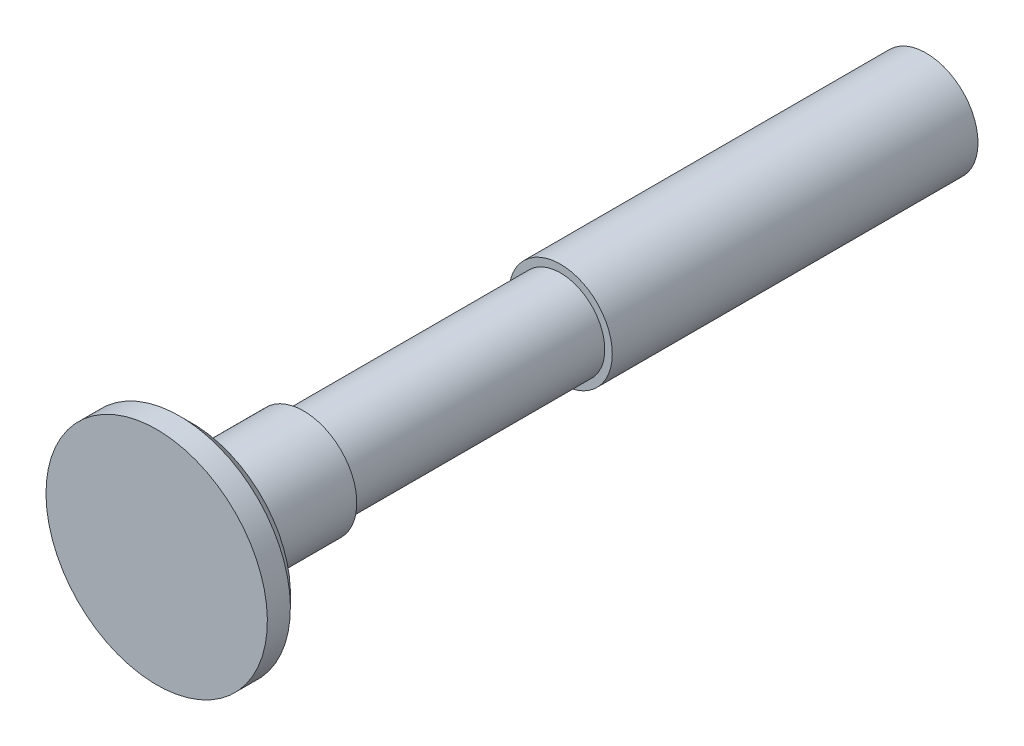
ISO-10303-21;
HEADER;
FILE_DESCRIPTION(('STEP AP214'),'2;1');
FILE_NAME('part.step','',(''),(''),'','','');
FILE_SCHEMA(('AUTOMOTIVE_DESIGN { 1 0 10303 214 1 1 1 1 }'));
ENDSEC;
DATA;
#1=APPLICATION_CONTEXT('core data for automotive mechanical design processes');
#2=APPLICATION_PROTOCOL_DEFINITION('international standard','automotive_design',2000,#1);
#3=PRODUCT_CONTEXT('',#1,'mechanical');
#4=PRODUCT('Part','Part','',(#3));
#5=PRODUCT_RELATED_PRODUCT_CATEGORY('part','',(#4));
#6=PRODUCT_DEFINITION_FORMATION('','',#4);
#7=PRODUCT_DEFINITION_CONTEXT('part definition',#1,'design');
#8=PRODUCT_DEFINITION('design','',#6,#7);
#9=PRODUCT_DEFINITION_SHAPE('','',#8);
#10=(LENGTH_UNIT() NAMED_UNIT(*) SI_UNIT(.MILLI.,.METRE.));
#11=(NAMED_UNIT(*) PLANE_ANGLE_UNIT() SI_UNIT($,.RADIAN.));
#12=(NAMED_UNIT(*) SI_UNIT($,.STERADIAN.) SOLID_ANGLE_UNIT());
#13=UNCERTAINTY_MEASURE_WITH_UNIT(LENGTH_MEASURE(1.E-05),#10,'distance_accuracy_value','');
#14=(GEOMETRIC_REPRESENTATION_CONTEXT(3) GLOBAL_UNCERTAINTY_ASSIGNED_CONTEXT((#13)) GLOBAL_UNIT_ASSIGNED_CONTEXT((#10,
#11,#12)) REPRESENTATION_CONTEXT('',''));
#15=CARTESIAN_POINT('',(0.,0.,0.));
#16=DIRECTION('',(0.,0.,1.));
#17=DIRECTION('',(1.,0.,0.));
#18=AXIS2_PLACEMENT_3D('',#15,#16,#17);
#19=CARTESIAN_POINT('',(0.,0.,38.));
#20=DIRECTION('',(0.,0.,-1.));
#21=DIRECTION('',(-1.,0.,0.));
#22=AXIS2_PLACEMENT_3D('',#19,#20,#21);
#23=CYLINDRICAL_SURFACE('',#22,5.);
#24=CARTESIAN_POINT('',(0.,0.,0.));
#25=DIRECTION('',(0.,0.,1.));
#26=DIRECTION('',(1.,0.,0.));
#27=AXIS2_PLACEMENT_3D('',#24,#25,#26);
#28=CIRCLE('',#27,5.);
#29=CARTESIAN_POINT('',(5.,0.,0.));
#30=VERTEX_POINT('',#29);
#31=EDGE_CURVE('E31',#30,#30,#28,.T.);
#32=ORIENTED_EDGE('',*,*,#31,.T.);
#33=EDGE_LOOP('',(#32));
#34=FACE_BOUND('',#33,.T.);
#35=CARTESIAN_POINT('',(0.,0.,29.));
#36=DIRECTION('',(0.,0.,1.));
#37=DIRECTION('',(1.,0.,0.));
#38=AXIS2_PLACEMENT_3D('',#35,#36,#37);
#39=CIRCLE('',#38,5.);
#40=CARTESIAN_POINT('',(5.,0.,29.));
#41=VERTEX_POINT('',#40);
#42=EDGE_CURVE('E9',#41,#41,#39,.T.);
#43=ORIENTED_EDGE('',*,*,#42,.F.);
#44=EDGE_LOOP('',(#43));
#45=FACE_BOUND('',#44,.T.);
#46=ADVANCED_FACE('F14',(#34,#45),#23,.T.);
#47=CARTESIAN_POINT('',(0.,0.,0.));
#48=DIRECTION('',(0.,0.,1.));
#49=DIRECTION('',(1.,0.,0.));
#50=AXIS2_PLACEMENT_3D('',#47,#48,#49);
#51=PLANE('',#50);
#52=CARTESIAN_POINT('',(0.,0.,0.));
#53=DIRECTION('',(0.,0.,1.));
#54=DIRECTION('',(1.,0.,0.));
#55=AXIS2_PLACEMENT_3D('',#52,#53,#54);
#56=CIRCLE('',#55,5.85);
#57=CARTESIAN_POINT('',(5.85,0.,0.));
#58=VERTEX_POINT('',#57);
#59=EDGE_CURVE('E26',#58,#58,#56,.T.);
#60=ORIENTED_EDGE('',*,*,#59,.T.);
#61=EDGE_LOOP('',(#60));
#62=FACE_BOUND('',#61,.T.);
#63=ORIENTED_EDGE('',*,*,#31,.F.);
#64=EDGE_LOOP('',(#63));
#65=FACE_BOUND('',#64,.T.);
#66=ADVANCED_FACE('F92',(#62,#65),#51,.T.);
#67=CARTESIAN_POINT('',(0.,0.,-41.3));
#68=DIRECTION('',(0.,0.,1.));
#69=DIRECTION('',(1.,0.,0.));
#70=AXIS2_PLACEMENT_3D('',#67,#68,#69);
#71=CYLINDRICAL_SURFACE('',#70,5.85);
#72=CARTESIAN_POINT('',(0.,0.,-41.3));
#73=DIRECTION('',(0.,0.,1.));
#74=DIRECTION('',(1.,0.,0.));
#75=AXIS2_PLACEMENT_3D('',#72,#73,#74);
#76=CIRCLE('',#75,5.85);
#77=CARTESIAN_POINT('',(5.85,0.,-41.3));
#78=VERTEX_POINT('',#77);
#79=EDGE_CURVE('E22',#78,#78,#76,.T.);
#80=CARTESIAN_POINT('',(5.85,0.,-41.3));
#81=CARTESIAN_POINT('',(5.85,0.,-40.8697916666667));
#82=CARTESIAN_POINT('',(5.85,0.,-40.4395833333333));
#83=CARTESIAN_POINT('',(5.85,0.,-39.5791666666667));
#84=CARTESIAN_POINT('',(5.85,0.,-39.1489583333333));
#85=CARTESIAN_POINT('',(5.85,0.,-38.2885416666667));
#86=CARTESIAN_POINT('',(5.85,0.,-37.8583333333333));
#87=CARTESIAN_POINT('',(5.85,0.,-36.9979166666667));
#88=CARTESIAN_POINT('',(5.85,0.,-36.5677083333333));
#89=CARTESIAN_POINT('',(5.85,0.,-35.7072916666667));
#90=CARTESIAN_POINT('',(5.85,0.,-35.2770833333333));
#91=CARTESIAN_POINT('',(5.85,0.,-34.4166666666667));
#92=CARTESIAN_POINT('',(5.85,0.,-33.9864583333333));
#93=CARTESIAN_POINT('',(5.85,0.,-33.1260416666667));
#94=CARTESIAN_POINT('',(5.85,0.,-32.6958333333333));
#95=CARTESIAN_POINT('',(5.85,0.,-31.8354166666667));
#96=CARTESIAN_POINT('',(5.85,0.,-31.4052083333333));
#97=CARTESIAN_POINT('',(5.85,0.,-30.5447916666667));
#98=CARTESIAN_POINT('',(5.85,0.,-30.1145833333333));
#99=CARTESIAN_POINT('',(5.85,0.,-29.2541666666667));
#100=CARTESIAN_POINT('',(5.85,0.,-28.8239583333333));
#101=CARTESIAN_POINT('',(5.85,0.,-27.9635416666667));
#102=CARTESIAN_POINT('',(5.85,0.,-27.5333333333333));
#103=CARTESIAN_POINT('',(5.85,0.,-26.6729166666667));
#104=CARTESIAN_POINT('',(5.85,0.,-26.2427083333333));
#105=CARTESIAN_POINT('',(5.85,0.,-25.3822916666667));
#106=CARTESIAN_POINT('',(5.85,0.,-24.9520833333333));
#107=CARTESIAN_POINT('',(5.85,0.,-24.0916666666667));
#108=CARTESIAN_POINT('',(5.85,0.,-23.6614583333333));
#109=CARTESIAN_POINT('',(5.85,0.,-22.8010416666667));
#110=CARTESIAN_POINT('',(5.85,0.,-22.3708333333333));
#111=CARTESIAN_POINT('',(5.85,0.,-21.5104166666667));
#112=CARTESIAN_POINT('',(5.85,0.,-21.0802083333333));
#113=CARTESIAN_POINT('',(5.85,0.,-20.2197916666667));
#114=CARTESIAN_POINT('',(5.85,0.,-19.7895833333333));
#115=CARTESIAN_POINT('',(5.85,0.,-18.9291666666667));
#116=CARTESIAN_POINT('',(5.85,0.,-18.4989583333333));
#117=CARTESIAN_POINT('',(5.85,0.,-17.6385416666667));
#118=CARTESIAN_POINT('',(5.85,0.,-17.2083333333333));
#119=CARTESIAN_POINT('',(5.85,0.,-16.3479166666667));
#120=CARTESIAN_POINT('',(5.85,0.,-15.9177083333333));
#121=CARTESIAN_POINT('',(5.85,0.,-15.0572916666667));
#122=CARTESIAN_POINT('',(5.85,0.,-14.6270833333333));
#123=CARTESIAN_POINT('',(5.85,0.,-13.7666666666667));
#124=CARTESIAN_POINT('',(5.85,0.,-13.3364583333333));
#125=CARTESIAN_POINT('',(5.85,0.,-12.4760416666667));
#126=CARTESIAN_POINT('',(5.85,0.,-12.0458333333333));
#127=CARTESIAN_POINT('',(5.85,0.,-11.1854166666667));
#128=CARTESIAN_POINT('',(5.85,0.,-10.7552083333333));
#129=CARTESIAN_POINT('',(5.85,0.,-9.89479166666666));
#130=CARTESIAN_POINT('',(5.85,0.,-9.46458333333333));
#131=CARTESIAN_POINT('',(5.85,0.,-8.60416666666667));
#132=CARTESIAN_POINT('',(5.85,0.,-8.17395833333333));
#133=CARTESIAN_POINT('',(5.85,0.,-7.31354166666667));
#134=CARTESIAN_POINT('',(5.85,0.,-6.88333333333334));
#135=CARTESIAN_POINT('',(5.85,0.,-6.02291666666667));
#136=CARTESIAN_POINT('',(5.85,0.,-5.59270833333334));
#137=CARTESIAN_POINT('',(5.85,0.,-4.73229166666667));
#138=CARTESIAN_POINT('',(5.85,0.,-4.30208333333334));
#139=CARTESIAN_POINT('',(5.85,0.,-3.44166666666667));
#140=CARTESIAN_POINT('',(5.85,0.,-3.01145833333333));
#141=CARTESIAN_POINT('',(5.85,0.,-2.15104166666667));
#142=CARTESIAN_POINT('',(5.85,0.,-1.72083333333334));
#143=CARTESIAN_POINT('',(5.85,0.,-0.860416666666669));
#144=CARTESIAN_POINT('',(5.85,0.,-0.430208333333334));
#145=CARTESIAN_POINT('',(5.85,0.,0.));
#146=B_SPLINE_CURVE_WITH_KNOTS('',3,(#80,#81,#82,#83,#84,#85,#86,#87,#88,#89,#90,#91,#92,#93,
#94,#95,#96,#97,#98,#99,#100,#101,#102,#103,#104,#105,#106,#107,#108,#109,#110,#111,#112,#113,
#114,#115,#116,#117,#118,#119,#120,#121,#122,#123,#124,#125,#126,#127,#128,#129,#130,#131,#132,
#133,#134,#135,#136,#137,#138,#139,#140,#141,#142,#143,#144,#145),.UNSPECIFIED.,.F.,.F.,(4,2,2,
2,2,2,2,2,2,2,2,2,2,2,2,2,2,2,2,2,2,2,2,2,2,2,2,2,2,2,2,2,4),(0.,1.290625,2.58125000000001,
3.871875,5.1625,6.453125,7.74375000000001,9.034375,10.325,11.615625,12.90625,14.196875,15.4875,
16.778125,18.06875,19.359375,20.65,21.940625,23.23125,24.521875,25.8125,27.103125,28.39375,
29.684375,30.975,32.265625,33.55625,34.846875,36.1375,37.428125,38.71875,40.009375,41.3),.UNSPECIFIED.);
#147=EDGE_CURVE('BSEAM16',#78,#58,#146,.T.);
#148=ORIENTED_EDGE('',*,*,#79,.T.);
#149=ORIENTED_EDGE('',*,*,#59,.F.);
#150=ORIENTED_EDGE('',*,*,#147,.T.);
#151=ORIENTED_EDGE('',*,*,#147,.F.);
#152=EDGE_LOOP('',(#148,#150,#149,#151));
#153=FACE_BOUND('',#152,.T.);
#154=ADVANCED_FACE('F16',(#153),#71,.T.);
#155=CARTESIAN_POINT('',(0.,0.,-41.3));
#156=DIRECTION('',(0.,0.,1.));
#157=DIRECTION('',(1.,0.,0.));
#158=AXIS2_PLACEMENT_3D('',#155,#156,#157);
#159=PLANE('',#158);
#160=ORIENTED_EDGE('',*,*,#79,.F.);
#161=EDGE_LOOP('',(#160));
#162=FACE_BOUND('',#161,.T.);
#163=ADVANCED_FACE('F105',(#162),#159,.F.);
#164=CARTESIAN_POINT('',(-4.28155412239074,-13.4735128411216,29.));
#165=DIRECTION('',(0.,0.,1.));
#166=DIRECTION('',(0.953037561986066,-0.302852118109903,0.));
#167=AXIS2_PLACEMENT_3D('',#164,#165,#166);
#168=PLANE('',#167);
#169=CARTESIAN_POINT('',(0.,0.,29.));
#170=DIRECTION('',(0.,0.,1.));
#171=DIRECTION('',(0.953037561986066,-0.302852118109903,0.));
#172=AXIS2_PLACEMENT_3D('',#169,#170,#171);
#173=CIRCLE('',#172,6.);
#174=CARTESIAN_POINT('',(5.71822537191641,-1.81711270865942,29.));
#175=VERTEX_POINT('',#174);
#176=EDGE_CURVE('E41',#175,#175,#173,.T.);
#177=ORIENTED_EDGE('',*,*,#176,.F.);
#178=EDGE_LOOP('',(#177));
#179=FACE_BOUND('',#178,.T.);
#180=ORIENTED_EDGE('',*,*,#42,.T.);
#181=EDGE_LOOP('',(#180));
#182=FACE_BOUND('',#181,.T.);
#183=ADVANCED_FACE('F107',(#179,#182),#168,.F.);
#184=CARTESIAN_POINT('',(-4.28155412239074,-13.4735128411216,45.6));
#185=DIRECTION('',(0.,0.,-1.));
#186=DIRECTION('',(-0.953037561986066,0.302852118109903,0.));
#187=AXIS2_PLACEMENT_3D('',#184,#185,#186);
#188=PLANE('',#187);
#189=CARTESIAN_POINT('',(0.,0.,45.6));
#190=DIRECTION('',(0.,0.,1.));
#191=DIRECTION('',(0.953037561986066,-0.302852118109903,0.));
#192=AXIS2_PLACEMENT_3D('',#189,#190,#191);
#193=CIRCLE('',#192,12.5);
#194=CARTESIAN_POINT('',(11.9129695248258,-3.78565147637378,45.6));
#195=VERTEX_POINT('',#194);
#196=EDGE_CURVE('E60',#195,#195,#193,.T.);
#197=ORIENTED_EDGE('',*,*,#196,.T.);
#198=EDGE_LOOP('',(#197));
#199=FACE_BOUND('',#198,.T.);
#200=ADVANCED_FACE('F64',(#199),#188,.F.);
#201=CARTESIAN_POINT('',(0.,0.,46.1));
#202=DIRECTION('',(0.,0.,1.));
#203=DIRECTION('',(0.953037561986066,-0.302852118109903,0.));
#204=AXIS2_PLACEMENT_3D('',#201,#202,#203);
#205=CYLINDRICAL_SURFACE('',#204,6.00000000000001);
#206=ORIENTED_EDGE('',*,*,#176,.T.);
#207=EDGE_LOOP('',(#206));
#208=FACE_BOUND('',#207,.T.);
#209=CARTESIAN_POINT('',(0.,0.,38.1));
#210=DIRECTION('',(0.,0.,1.));
#211=DIRECTION('',(0.953037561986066,-0.302852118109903,0.));
#212=AXIS2_PLACEMENT_3D('',#209,#210,#211);
#213=CIRCLE('',#212,6.00000000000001);
#214=CARTESIAN_POINT('',(5.71822537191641,-1.81711270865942,38.1));
#215=VERTEX_POINT('',#214);
#216=EDGE_CURVE('E46',#215,#215,#213,.T.);
#217=ORIENTED_EDGE('',*,*,#216,.F.);
#218=EDGE_LOOP('',(#217));
#219=FACE_BOUND('',#218,.T.);
#220=ADVANCED_FACE('F88',(#208,#219),#205,.T.);
#221=CARTESIAN_POINT('',(0.,0.,38.1));
#222=DIRECTION('',(0.,0.,1.));
#223=DIRECTION('',(0.953037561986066,-0.302852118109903,0.));
#224=AXIS2_PLACEMENT_3D('',#221,#222,#223);
#225=CONICAL_SURFACE('',#224,6.00000000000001,0.785398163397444);
#226=CARTESIAN_POINT('',(0.,0.,41.6));
#227=DIRECTION('',(0.,0.,1.));
#228=DIRECTION('',(0.953037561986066,-0.302852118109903,0.));
#229=AXIS2_PLACEMENT_3D('',#226,#227,#228);
#230=CIRCLE('',#229,9.50000000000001);
#231=CARTESIAN_POINT('',(9.05385683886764,-2.87709512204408,41.6));
#232=VERTEX_POINT('',#231);
#233=EDGE_CURVE('E51',#232,#232,#230,.T.);
#234=ORIENTED_EDGE('',*,*,#233,.F.);
#235=EDGE_LOOP('',(#234));
#236=FACE_BOUND('',#235,.T.);
#237=ORIENTED_EDGE('',*,*,#216,.T.);
#238=EDGE_LOOP('',(#237));
#239=FACE_BOUND('',#238,.T.);
#240=ADVANCED_FACE('F80',(#236,#239),#225,.T.);
#241=CARTESIAN_POINT('',(-4.28155412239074,-13.4735128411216,41.6));
#242=DIRECTION('',(0.,0.,-1.));
#243=DIRECTION('',(-0.953037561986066,0.302852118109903,0.));
#244=AXIS2_PLACEMENT_3D('',#241,#242,#243);
#245=PLANE('',#244);
#246=ORIENTED_EDGE('',*,*,#233,.T.);
#247=EDGE_LOOP('',(#246));
#248=FACE_BOUND('',#247,.T.);
#249=CARTESIAN_POINT('',(0.,0.,41.6));
#250=DIRECTION('',(0.,0.,1.));
#251=DIRECTION('',(0.953037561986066,-0.302852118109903,0.));
#252=AXIS2_PLACEMENT_3D('',#249,#250,#251);
#253=CIRCLE('',#252,11.1);
#254=CARTESIAN_POINT('',(10.5787169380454,-3.36165851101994,41.6));
#255=VERTEX_POINT('',#254);
#256=EDGE_CURVE('E54',#255,#255,#253,.T.);
#257=ORIENTED_EDGE('',*,*,#256,.F.);
#258=EDGE_LOOP('',(#257));
#259=FACE_BOUND('',#258,.T.);
#260=ADVANCED_FACE('F75',(#248,#259),#245,.T.);
#261=CARTESIAN_POINT('',(0.,0.,41.6));
#262=DIRECTION('',(0.,0.,1.));
#263=DIRECTION('',(0.953037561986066,-0.302852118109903,0.));
#264=AXIS2_PLACEMENT_3D('',#261,#262,#263);
#265=CONICAL_SURFACE('',#264,11.1,0.785398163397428);
#266=CARTESIAN_POINT('',(0.,0.,43.));
#267=DIRECTION('',(0.,0.,1.));
#268=DIRECTION('',(0.953037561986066,-0.302852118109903,0.));
#269=AXIS2_PLACEMENT_3D('',#266,#267,#268);
#270=CIRCLE('',#269,12.5);
#271=CARTESIAN_POINT('',(11.9129695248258,-3.78565147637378,43.));
#272=VERTEX_POINT('',#271);
#273=EDGE_CURVE('E57',#272,#272,#270,.T.);
#274=ORIENTED_EDGE('',*,*,#273,.F.);
#275=EDGE_LOOP('',(#274));
#276=FACE_BOUND('',#275,.T.);
#277=ORIENTED_EDGE('',*,*,#256,.T.);
#278=EDGE_LOOP('',(#277));
#279=FACE_BOUND('',#278,.T.);
#280=ADVANCED_FACE('F69',(#276,#279),#265,.T.);
#281=CARTESIAN_POINT('',(0.,0.,46.1));
#282=DIRECTION('',(0.,0.,1.));
#283=DIRECTION('',(0.953037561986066,-0.302852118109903,0.));
#284=AXIS2_PLACEMENT_3D('',#281,#282,#283);
#285=CYLINDRICAL_SURFACE('',#284,12.5);
#286=ORIENTED_EDGE('',*,*,#196,.F.);
#287=EDGE_LOOP('',(#286));
#288=FACE_BOUND('',#287,.T.);
#289=ORIENTED_EDGE('',*,*,#273,.T.);
#290=EDGE_LOOP('',(#289));
#291=FACE_BOUND('',#290,.T.);
#292=ADVANCED_FACE('F66',(#288,#291),#285,.T.);
#293=CLOSED_SHELL('',(#46,#66,#154,#163,#183,#200,#220,#240,#260,#280,#292));
#294=CARTESIAN_POINT('',(0.,0.,38.));
#295=DIRECTION('',(0.,0.,1.));
#296=DIRECTION('',(1.,0.,0.));
#297=AXIS2_PLACEMENT_3D('',#294,#295,#296);
#298=PLANE('',#297);
#299=CARTESIAN_POINT('',(0.,0.,38.));
#300=DIRECTION('',(0.,0.,1.));
#301=DIRECTION('',(1.,0.,0.));
#302=AXIS2_PLACEMENT_3D('',#299,#300,#301);
#303=CIRCLE('',#302,2.387);
#304=CARTESIAN_POINT('',(2.387,0.,38.));
#305=VERTEX_POINT('',#304);
#306=EDGE_CURVE('E34',#305,#305,#303,.T.);
#307=ORIENTED_EDGE('',*,*,#306,.T.);
#308=EDGE_LOOP('',(#307));
#309=FACE_BOUND('',#308,.T.);
#310=ADVANCED_FACE('F103',(#309),#298,.T.);
#311=CARTESIAN_POINT('',(-4.28155412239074,-13.4735128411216,43.));
#312=DIRECTION('',(0.,0.,1.));
#313=DIRECTION('',(0.953037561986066,-0.302852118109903,0.));
#314=AXIS2_PLACEMENT_3D('',#311,#312,#313);
#315=PLANE('',#314);
#316=CARTESIAN_POINT('',(0.,0.,43.));
#317=DIRECTION('',(0.,0.,1.));
#318=DIRECTION('',(0.953037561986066,-0.302852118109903,0.));
#319=AXIS2_PLACEMENT_3D('',#316,#317,#318);
#320=CIRCLE('',#319,2.387);
#321=CARTESIAN_POINT('',(2.27490066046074,-0.722908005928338,43.));
#322=VERTEX_POINT('',#321);
#323=EDGE_CURVE('E36',#322,#322,#320,.T.);
#324=ORIENTED_EDGE('',*,*,#323,.F.);
#325=EDGE_LOOP('',(#324));
#326=FACE_BOUND('',#325,.T.);
#327=ADVANCED_FACE('F191',(#326),#315,.F.);
#328=CARTESIAN_POINT('',(0.,0.,46.1));
#329=DIRECTION('',(0.,0.,1.));
#330=DIRECTION('',(0.953037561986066,-0.302852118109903,0.));
#331=AXIS2_PLACEMENT_3D('',#328,#329,#330);
#332=CYLINDRICAL_SURFACE('',#331,2.387);
#333=ORIENTED_EDGE('',*,*,#306,.F.);
#334=EDGE_LOOP('',(#333));
#335=FACE_BOUND('',#334,.T.);
#336=ORIENTED_EDGE('',*,*,#323,.T.);
#337=EDGE_LOOP('',(#336));
#338=FACE_BOUND('',#337,.T.);
#339=ADVANCED_FACE('F197',(#335,#338),#332,.F.);
#340=CLOSED_SHELL('',(#310,#327,#339));
#341=ORIENTED_CLOSED_SHELL('',*,#340,.T.);
#342=BREP_WITH_VOIDS('B1',#293,(#341));
#343=ADVANCED_BREP_SHAPE_REPRESENTATION('',(#18,#342),#14);
#344=SHAPE_DEFINITION_REPRESENTATION(#9,#343);
ENDSEC;
END-ISO-10303-21;
